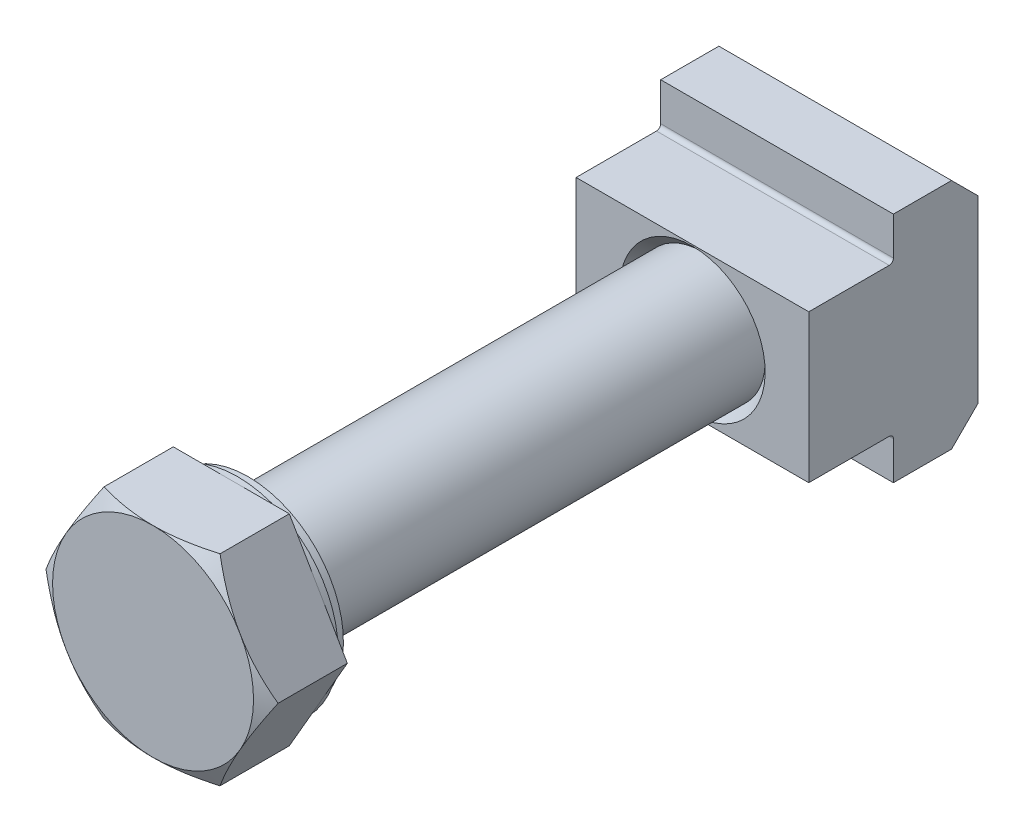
ISO-10303-21;
HEADER;
FILE_DESCRIPTION(('STEP AP214'),'2;1');
FILE_NAME('part.step','',(''),(''),'','','');
FILE_SCHEMA(('AUTOMOTIVE_DESIGN { 1 0 10303 214 1 1 1 1 }'));
ENDSEC;
DATA;
#1=APPLICATION_CONTEXT('core data for automotive mechanical design processes');
#2=APPLICATION_PROTOCOL_DEFINITION('international standard','automotive_design',2000,#1);
#3=PRODUCT_CONTEXT('',#1,'mechanical');
#4=PRODUCT('Part','Part','',(#3));
#5=PRODUCT_RELATED_PRODUCT_CATEGORY('part','',(#4));
#6=PRODUCT_DEFINITION_FORMATION('','',#4);
#7=PRODUCT_DEFINITION_CONTEXT('part definition',#1,'design');
#8=PRODUCT_DEFINITION('design','',#6,#7);
#9=PRODUCT_DEFINITION_SHAPE('','',#8);
#10=(LENGTH_UNIT() NAMED_UNIT(*) SI_UNIT(.MILLI.,.METRE.));
#11=(NAMED_UNIT(*) PLANE_ANGLE_UNIT() SI_UNIT($,.RADIAN.));
#12=(NAMED_UNIT(*) SI_UNIT($,.STERADIAN.) SOLID_ANGLE_UNIT());
#13=UNCERTAINTY_MEASURE_WITH_UNIT(LENGTH_MEASURE(1.E-05),#10,'distance_accuracy_value','');
#14=(GEOMETRIC_REPRESENTATION_CONTEXT(3) GLOBAL_UNCERTAINTY_ASSIGNED_CONTEXT((#13)) GLOBAL_UNIT_ASSIGNED_CONTEXT((#10,
#11,#12)) REPRESENTATION_CONTEXT('',''));
#15=CARTESIAN_POINT('',(0.,0.,0.));
#16=DIRECTION('',(0.,0.,1.));
#17=DIRECTION('',(1.,0.,0.));
#18=AXIS2_PLACEMENT_3D('',#15,#16,#17);
#19=CARTESIAN_POINT('',(4.75,0.,9.));
#20=DIRECTION('',(0.,0.,1.));
#21=DIRECTION('',(0.,-1.,0.));
#22=AXIS2_PLACEMENT_3D('',#19,#20,#21);
#23=PLANE('',#22);
#24=CARTESIAN_POINT('',(0.,0.,9.));
#25=DIRECTION('',(0.,0.,-1.));
#26=DIRECTION('',(0.,1.,0.));
#27=AXIS2_PLACEMENT_3D('',#24,#25,#26);
#28=CIRCLE('',#27,9.5);
#29=CARTESIAN_POINT('',(0.,-9.5,9.));
#30=VERTEX_POINT('',#29);
#31=CARTESIAN_POINT('',(-8.2272413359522,-4.75,9.));
#32=VERTEX_POINT('',#31);
#33=EDGE_CURVE('E258',#30,#32,#28,.T.);
#34=ORIENTED_EDGE('',*,*,#33,.F.);
#35=CARTESIAN_POINT('',(0.,0.,9.));
#36=DIRECTION('',(0.,0.,-1.));
#37=DIRECTION('',(0.,1.,0.));
#38=AXIS2_PLACEMENT_3D('',#35,#36,#37);
#39=CIRCLE('',#38,9.5);
#40=CARTESIAN_POINT('',(8.2272413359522,-4.75,9.));
#41=VERTEX_POINT('',#40);
#42=EDGE_CURVE('E252',#41,#30,#39,.T.);
#43=ORIENTED_EDGE('',*,*,#42,.F.);
#44=CARTESIAN_POINT('',(0.,0.,9.));
#45=DIRECTION('',(0.,0.,-1.));
#46=DIRECTION('',(0.,1.,0.));
#47=AXIS2_PLACEMENT_3D('',#44,#45,#46);
#48=CIRCLE('',#47,9.5);
#49=CARTESIAN_POINT('',(8.2272413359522,4.75,9.));
#50=VERTEX_POINT('',#49);
#51=EDGE_CURVE('E249',#50,#41,#48,.T.);
#52=ORIENTED_EDGE('',*,*,#51,.F.);
#53=CARTESIAN_POINT('',(0.,0.,9.));
#54=DIRECTION('',(0.,0.,-1.));
#55=DIRECTION('',(0.,1.,0.));
#56=AXIS2_PLACEMENT_3D('',#53,#54,#55);
#57=CIRCLE('',#56,9.5);
#58=CARTESIAN_POINT('',(0.,9.5,9.));
#59=VERTEX_POINT('',#58);
#60=EDGE_CURVE('E245',#59,#50,#57,.T.);
#61=ORIENTED_EDGE('',*,*,#60,.F.);
#62=CARTESIAN_POINT('',(0.,0.,9.));
#63=DIRECTION('',(0.,0.,-1.));
#64=DIRECTION('',(0.,1.,0.));
#65=AXIS2_PLACEMENT_3D('',#62,#63,#64);
#66=CIRCLE('',#65,9.5);
#67=CARTESIAN_POINT('',(-8.2272413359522,4.75,9.));
#68=VERTEX_POINT('',#67);
#69=EDGE_CURVE('E255',#68,#59,#66,.T.);
#70=ORIENTED_EDGE('',*,*,#69,.F.);
#71=CARTESIAN_POINT('',(0.,0.,9.));
#72=DIRECTION('',(0.,0.,-1.));
#73=DIRECTION('',(0.,1.,0.));
#74=AXIS2_PLACEMENT_3D('',#71,#72,#73);
#75=CIRCLE('',#74,9.5);
#76=EDGE_CURVE('E261',#32,#68,#75,.T.);
#77=ORIENTED_EDGE('',*,*,#76,.F.);
#78=EDGE_LOOP('',(#34,#43,#52,#61,#70,#77));
#79=FACE_BOUND('',#78,.T.);
#80=ADVANCED_FACE('F14',(#79),#23,.T.);
#81=CARTESIAN_POINT('',(0.,0.,8.1464031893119));
#82=DIRECTION('',(0.,0.,-1.));
#83=DIRECTION('',(0.,1.,0.));
#84=AXIS2_PLACEMENT_3D('',#81,#82,#83);
#85=CONICAL_SURFACE('',#84,10.9784730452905,1.0471975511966);
#86=CARTESIAN_POINT('',(-10.9696551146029,0.,8.1514942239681));
#87=CARTESIAN_POINT('',(-10.7464238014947,-0.386647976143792,8.28040921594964));
#88=CARTESIAN_POINT('',(-10.5214047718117,-0.776392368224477,8.3985178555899));
#89=CARTESIAN_POINT('',(-10.0693831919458,-1.55931671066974,8.60680031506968));
#90=CARTESIAN_POINT('',(-9.84239640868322,-1.95246935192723,8.69711226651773));
#91=CARTESIAN_POINT('',(-9.4997740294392,-2.545908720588,8.80800000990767));
#92=CARTESIAN_POINT('',(-9.3851337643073,-2.74447148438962,8.84087935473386));
#93=CARTESIAN_POINT('',(-9.15530440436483,-3.14254761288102,8.89779418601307));
#94=CARTESIAN_POINT('',(-9.04011532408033,-3.34206095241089,8.92182990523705));
#95=CARTESIAN_POINT('',(-8.80876226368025,-3.74277620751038,8.96063517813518));
#96=CARTESIAN_POINT('',(-8.69259629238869,-3.94398157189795,8.97535760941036));
#97=CARTESIAN_POINT('',(-8.46003588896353,-4.34678800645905,8.99506039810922));
#98=CARTESIAN_POINT('',(-8.34364141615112,-4.54838914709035,9.00003882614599));
#99=CARTESIAN_POINT('',(-8.2272413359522,-4.75,9.));
#100=B_SPLINE_CURVE_WITH_KNOTS('',3,(#86,#87,#88,#89,#90,#91,#92,#93,#94,#95,#96,#97,#98,#99),
.UNSPECIFIED.,.F.,.F.,(4,2,2,2,2,2,4),(0.,1.39466965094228,2.78229242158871,3.47701423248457,
4.17171775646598,4.86990873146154,5.56823793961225),.UNSPECIFIED.);
#101=CARTESIAN_POINT('',(-10.9696551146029,0.,8.1514942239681));
#102=VERTEX_POINT('',#101);
#103=EDGE_CURVE('E136',#102,#32,#100,.T.);
#104=ORIENTED_EDGE('',*,*,#103,.T.);
#105=ORIENTED_EDGE('',*,*,#76,.T.);
#106=CARTESIAN_POINT('',(-8.2272413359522,4.75,9.));
#107=CARTESIAN_POINT('',(-8.34364141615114,4.54838914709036,9.00003882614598));
#108=CARTESIAN_POINT('',(-8.46003588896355,4.34678800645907,8.99506039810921));
#109=CARTESIAN_POINT('',(-8.69259629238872,3.94398157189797,8.97535760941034));
#110=CARTESIAN_POINT('',(-8.80876226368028,3.7427762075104,8.96063517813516));
#111=CARTESIAN_POINT('',(-9.04011532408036,3.34206095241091,8.92182990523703));
#112=CARTESIAN_POINT('',(-9.15530440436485,3.14254761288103,8.89779418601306));
#113=CARTESIAN_POINT('',(-9.38513376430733,2.74447148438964,8.84087935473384));
#114=CARTESIAN_POINT('',(-9.49977402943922,2.54590872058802,8.80800000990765));
#115=CARTESIAN_POINT('',(-9.84239640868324,1.95246935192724,8.69711226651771));
#116=CARTESIAN_POINT('',(-10.0693831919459,1.55931671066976,8.60680031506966));
#117=CARTESIAN_POINT('',(-10.5214047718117,0.776392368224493,8.39851785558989));
#118=CARTESIAN_POINT('',(-10.7464238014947,0.386647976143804,8.28040921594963));
#119=CARTESIAN_POINT('',(-10.9696551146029,0.,8.1514942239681));
#120=B_SPLINE_CURVE_WITH_KNOTS('',3,(#106,#107,#108,#109,#110,#111,#112,#113,#114,#115,#116,
#117,#118,#119),.UNSPECIFIED.,.F.,.F.,(4,2,2,2,2,2,4),(0.,0.698329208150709,1.39652018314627,
2.09122370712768,2.78594551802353,4.17356828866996,5.56823793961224),.UNSPECIFIED.);
#121=EDGE_CURVE('E356',#68,#102,#120,.T.);
#122=ORIENTED_EDGE('',*,*,#121,.T.);
#123=EDGE_LOOP('',(#104,#105,#122));
#124=FACE_BOUND('',#123,.T.);
#125=ADVANCED_FACE('F387',(#124),#85,.T.);
#126=CARTESIAN_POINT('',(0.,0.,8.14640318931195));
#127=DIRECTION('',(0.,0.,-1.));
#128=DIRECTION('',(0.,1.,0.));
#129=AXIS2_PLACEMENT_3D('',#126,#127,#128);
#130=CONICAL_SURFACE('',#129,10.9784730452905,1.0471975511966);
#131=CARTESIAN_POINT('',(-5.48482755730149,-9.5,8.1514942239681));
#132=CARTESIAN_POINT('',(-5.038364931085,-9.5,8.28040921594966));
#133=CARTESIAN_POINT('',(-4.58832687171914,-9.5,8.39851785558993));
#134=CARTESIAN_POINT('',(-3.68428371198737,-9.5,8.60680031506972));
#135=CARTESIAN_POINT('',(-3.23031014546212,-9.5,8.69711226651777));
#136=CARTESIAN_POINT('',(-2.54506538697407,-9.5,8.80800000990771));
#137=CARTESIAN_POINT('',(-2.31578485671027,-9.5,8.8408793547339));
#138=CARTESIAN_POINT('',(-1.85612613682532,-9.5,8.89779418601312));
#139=CARTESIAN_POINT('',(-1.62574797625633,-9.5,8.92182990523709));
#140=CARTESIAN_POINT('',(-1.16304185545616,-9.5,8.96063517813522));
#141=CARTESIAN_POINT('',(-0.930709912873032,-9.5,8.97535760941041));
#142=CARTESIAN_POINT('',(-0.465589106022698,-9.5,8.99506039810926));
#143=CARTESIAN_POINT('',(-0.232800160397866,-9.5,9.00003882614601));
#144=CARTESIAN_POINT('',(0.,-9.5,9.));
#145=B_SPLINE_CURVE_WITH_KNOTS('',3,(#131,#132,#133,#134,#135,#136,#137,#138,#139,#140,#141,
#142,#143,#144),.UNSPECIFIED.,.F.,.F.,(4,2,2,2,2,2,4),(0.,1.3946696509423,2.78229242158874,
3.47701423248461,4.17171775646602,4.86990873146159,5.56823793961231),.UNSPECIFIED.);
#146=CARTESIAN_POINT('',(-5.48482755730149,-9.5,8.1514942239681));
#147=VERTEX_POINT('',#146);
#148=EDGE_CURVE('E206',#147,#30,#145,.T.);
#149=ORIENTED_EDGE('',*,*,#148,.T.);
#150=ORIENTED_EDGE('',*,*,#33,.T.);
#151=CARTESIAN_POINT('',(-8.2272413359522,-4.75,9.));
#152=CARTESIAN_POINT('',(-8.11084125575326,-4.95161085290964,9.00003882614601));
#153=CARTESIAN_POINT('',(-7.99444678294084,-5.15321199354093,8.99506039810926));
#154=CARTESIAN_POINT('',(-7.76188637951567,-5.55601842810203,8.9753576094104));
#155=CARTESIAN_POINT('',(-7.64572040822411,-5.7572237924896,8.96063517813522));
#156=CARTESIAN_POINT('',(-7.41436734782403,-6.1579390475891,8.92182990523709));
#157=CARTESIAN_POINT('',(-7.29917826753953,-6.35745238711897,8.89779418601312));
#158=CARTESIAN_POINT('',(-7.06934890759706,-6.75552851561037,8.8408793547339));
#159=CARTESIAN_POINT('',(-6.95470864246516,-6.95409127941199,8.80800000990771));
#160=CARTESIAN_POINT('',(-6.61208626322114,-7.54753064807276,8.69711226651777));
#161=CARTESIAN_POINT('',(-6.38509947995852,-7.94068328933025,8.60680031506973));
#162=CARTESIAN_POINT('',(-5.93307790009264,-8.72360763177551,8.39851785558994));
#163=CARTESIAN_POINT('',(-5.70805887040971,-9.1133520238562,8.28040921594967));
#164=CARTESIAN_POINT('',(-5.48482755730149,-9.5,8.1514942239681));
#165=B_SPLINE_CURVE_WITH_KNOTS('',3,(#151,#152,#153,#154,#155,#156,#157,#158,#159,#160,#161,
#162,#163,#164),.UNSPECIFIED.,.F.,.F.,(4,2,2,2,2,2,4),(0.,0.698329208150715,1.39652018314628,
2.09122370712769,2.78594551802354,4.17356828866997,5.56823793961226),.UNSPECIFIED.);
#166=EDGE_CURVE('E198',#32,#147,#165,.T.);
#167=ORIENTED_EDGE('',*,*,#166,.T.);
#168=EDGE_LOOP('',(#149,#150,#167));
#169=FACE_BOUND('',#168,.T.);
#170=ADVANCED_FACE('F340',(#169),#130,.T.);
#171=CARTESIAN_POINT('',(0.,0.,8.14640318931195));
#172=DIRECTION('',(0.,0.,-1.));
#173=DIRECTION('',(0.,1.,0.));
#174=AXIS2_PLACEMENT_3D('',#171,#172,#173);
#175=CONICAL_SURFACE('',#174,10.9784730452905,1.0471975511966);
#176=CARTESIAN_POINT('',(5.4848275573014,-9.5,8.1514942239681));
#177=CARTESIAN_POINT('',(5.70805887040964,-9.11335202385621,8.28040921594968));
#178=CARTESIAN_POINT('',(5.93307790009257,-8.72360763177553,8.39851785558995));
#179=CARTESIAN_POINT('',(6.38509947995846,-7.94068328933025,8.60680031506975));
#180=CARTESIAN_POINT('',(6.61208626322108,-7.54753064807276,8.69711226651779));
#181=CARTESIAN_POINT('',(6.95470864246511,-6.95409127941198,8.80800000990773));
#182=CARTESIAN_POINT('',(7.06934890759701,-6.75552851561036,8.84087935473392));
#183=CARTESIAN_POINT('',(7.29917826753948,-6.35745238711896,8.89779418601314));
#184=CARTESIAN_POINT('',(7.41436734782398,-6.15793904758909,8.92182990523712));
#185=CARTESIAN_POINT('',(7.64572040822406,-5.75722379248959,8.96063517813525));
#186=CARTESIAN_POINT('',(7.76188637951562,-5.55601842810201,8.97535760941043));
#187=CARTESIAN_POINT('',(7.9944467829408,-5.15321199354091,8.99506039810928));
#188=CARTESIAN_POINT('',(8.11084125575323,-4.95161085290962,9.00003882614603));
#189=CARTESIAN_POINT('',(8.2272413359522,-4.75,9.));
#190=B_SPLINE_CURVE_WITH_KNOTS('',3,(#176,#177,#178,#179,#180,#181,#182,#183,#184,#185,#186,
#187,#188,#189),.UNSPECIFIED.,.F.,.F.,(4,2,2,2,2,2,4),(0.,1.3946696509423,2.78229242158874,
3.4770142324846,4.17171775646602,4.86990873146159,5.56823793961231),.UNSPECIFIED.);
#191=CARTESIAN_POINT('',(5.4848275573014,-9.5,8.1514942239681));
#192=VERTEX_POINT('',#191);
#193=EDGE_CURVE('E218',#192,#41,#190,.T.);
#194=ORIENTED_EDGE('',*,*,#193,.T.);
#195=ORIENTED_EDGE('',*,*,#42,.T.);
#196=CARTESIAN_POINT('',(0.,-9.5,9.));
#197=CARTESIAN_POINT('',(0.232800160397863,-9.5,9.00003882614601));
#198=CARTESIAN_POINT('',(0.465589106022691,-9.5,8.99506039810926));
#199=CARTESIAN_POINT('',(0.930709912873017,-9.5,8.97535760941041));
#200=CARTESIAN_POINT('',(1.16304185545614,-9.5,8.96063517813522));
#201=CARTESIAN_POINT('',(1.6257479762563,-9.5,8.92182990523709));
#202=CARTESIAN_POINT('',(1.85612613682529,-9.5,8.89779418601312));
#203=CARTESIAN_POINT('',(2.31578485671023,-9.5,8.8408793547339));
#204=CARTESIAN_POINT('',(2.54506538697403,-9.5,8.80800000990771));
#205=CARTESIAN_POINT('',(3.23031014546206,-9.5,8.69711226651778));
#206=CARTESIAN_POINT('',(3.68428371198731,-9.50000000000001,8.60680031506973));
#207=CARTESIAN_POINT('',(4.58832687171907,-9.50000000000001,8.39851785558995));
#208=CARTESIAN_POINT('',(5.03836493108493,-9.50000000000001,8.28040921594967));
#209=CARTESIAN_POINT('',(5.4848275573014,-9.5,8.1514942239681));
#210=B_SPLINE_CURVE_WITH_KNOTS('',3,(#196,#197,#198,#199,#200,#201,#202,#203,#204,#205,#206,
#207,#208,#209),.UNSPECIFIED.,.F.,.F.,(4,2,2,2,2,2,4),(0.,0.69832920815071,1.39652018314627,
2.09122370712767,2.78594551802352,4.17356828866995,5.56823793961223),.UNSPECIFIED.);
#211=EDGE_CURVE('E212',#30,#192,#210,.T.);
#212=ORIENTED_EDGE('',*,*,#211,.T.);
#213=EDGE_LOOP('',(#194,#195,#212));
#214=FACE_BOUND('',#213,.T.);
#215=ADVANCED_FACE('F337',(#214),#175,.T.);
#216=CARTESIAN_POINT('',(0.,0.,8.14640318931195));
#217=DIRECTION('',(0.,0.,-1.));
#218=DIRECTION('',(0.,1.,0.));
#219=AXIS2_PLACEMENT_3D('',#216,#217,#218);
#220=CONICAL_SURFACE('',#219,10.9784730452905,1.0471975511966);
#221=ORIENTED_EDGE('',*,*,#69,.T.);
#222=CARTESIAN_POINT('',(0.,9.5,9.));
#223=CARTESIAN_POINT('',(-0.232800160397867,9.5,9.00003882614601));
#224=CARTESIAN_POINT('',(-0.465589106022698,9.5,8.99506039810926));
#225=CARTESIAN_POINT('',(-0.930709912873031,9.5,8.9753576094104));
#226=CARTESIAN_POINT('',(-1.16304185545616,9.5,8.96063517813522));
#227=CARTESIAN_POINT('',(-1.62574797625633,9.5,8.92182990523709));
#228=CARTESIAN_POINT('',(-1.85612613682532,9.5,8.89779418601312));
#229=CARTESIAN_POINT('',(-2.31578485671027,9.5,8.8408793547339));
#230=CARTESIAN_POINT('',(-2.54506538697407,9.5,8.8080000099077));
#231=CARTESIAN_POINT('',(-3.23031014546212,9.5,8.69711226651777));
#232=CARTESIAN_POINT('',(-3.68428371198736,9.50000000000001,8.60680031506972));
#233=CARTESIAN_POINT('',(-4.58832687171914,9.50000000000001,8.39851785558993));
#234=CARTESIAN_POINT('',(-5.038364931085,9.50000000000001,8.28040921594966));
#235=CARTESIAN_POINT('',(-5.48482755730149,9.5,8.1514942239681));
#236=B_SPLINE_CURVE_WITH_KNOTS('',3,(#222,#223,#224,#225,#226,#227,#228,#229,#230,#231,#232,
#233,#234,#235),.UNSPECIFIED.,.F.,.F.,(4,2,2,2,2,2,4),(0.,0.698329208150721,1.39652018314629,
2.09122370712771,2.78594551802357,4.17356828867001,5.56823793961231),.UNSPECIFIED.);
#237=CARTESIAN_POINT('',(-5.48482755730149,9.5,8.1514942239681));
#238=VERTEX_POINT('',#237);
#239=EDGE_CURVE('E223',#59,#238,#236,.T.);
#240=ORIENTED_EDGE('',*,*,#239,.T.);
#241=CARTESIAN_POINT('',(-5.48482755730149,9.5,8.1514942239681));
#242=CARTESIAN_POINT('',(-5.70805887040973,9.11335202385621,8.28040921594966));
#243=CARTESIAN_POINT('',(-5.93307790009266,8.72360763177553,8.39851785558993));
#244=CARTESIAN_POINT('',(-6.38509947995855,7.94068328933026,8.60680031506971));
#245=CARTESIAN_POINT('',(-6.61208626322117,7.54753064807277,8.69711226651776));
#246=CARTESIAN_POINT('',(-6.95470864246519,6.954091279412,8.80800000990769));
#247=CARTESIAN_POINT('',(-7.06934890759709,6.75552851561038,8.84087935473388));
#248=CARTESIAN_POINT('',(-7.29917826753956,6.35745238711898,8.8977941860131));
#249=CARTESIAN_POINT('',(-7.41436734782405,6.15793904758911,8.92182990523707));
#250=CARTESIAN_POINT('',(-7.64572040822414,5.75722379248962,8.9606351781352));
#251=CARTESIAN_POINT('',(-7.7618863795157,5.55601842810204,8.97535760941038));
#252=CARTESIAN_POINT('',(-7.99444678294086,5.15321199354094,8.99506039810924));
#253=CARTESIAN_POINT('',(-8.11084125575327,4.95161085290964,9.000038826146));
#254=CARTESIAN_POINT('',(-8.2272413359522,4.75,9.));
#255=B_SPLINE_CURVE_WITH_KNOTS('',3,(#241,#242,#243,#244,#245,#246,#247,#248,#249,#250,#251,
#252,#253,#254),.UNSPECIFIED.,.F.,.F.,(4,2,2,2,2,2,4),(0.,1.39466965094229,2.78229242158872,
3.47701423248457,4.17171775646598,4.86990873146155,5.56823793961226),.UNSPECIFIED.);
#256=EDGE_CURVE('E207',#238,#68,#255,.T.);
#257=ORIENTED_EDGE('',*,*,#256,.T.);
#258=EDGE_LOOP('',(#221,#240,#257));
#259=FACE_BOUND('',#258,.T.);
#260=ADVANCED_FACE('F288',(#259),#220,.T.);
#261=CARTESIAN_POINT('',(0.,0.,8.14640318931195));
#262=DIRECTION('',(0.,0.,-1.));
#263=DIRECTION('',(0.,1.,0.));
#264=AXIS2_PLACEMENT_3D('',#261,#262,#263);
#265=CONICAL_SURFACE('',#264,10.9784730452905,1.0471975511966);
#266=ORIENTED_EDGE('',*,*,#60,.T.);
#267=CARTESIAN_POINT('',(8.2272413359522,4.75,9.));
#268=CARTESIAN_POINT('',(8.11084125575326,4.95161085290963,9.00003882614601));
#269=CARTESIAN_POINT('',(7.99444678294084,5.15321199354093,8.99506039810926));
#270=CARTESIAN_POINT('',(7.76188637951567,5.55601842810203,8.9753576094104));
#271=CARTESIAN_POINT('',(7.64572040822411,5.7572237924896,8.96063517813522));
#272=CARTESIAN_POINT('',(7.41436734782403,6.15793904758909,8.92182990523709));
#273=CARTESIAN_POINT('',(7.29917826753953,6.35745238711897,8.89779418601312));
#274=CARTESIAN_POINT('',(7.06934890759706,6.75552851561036,8.8408793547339));
#275=CARTESIAN_POINT('',(6.95470864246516,6.95409127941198,8.80800000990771));
#276=CARTESIAN_POINT('',(6.61208626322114,7.54753064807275,8.69711226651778));
#277=CARTESIAN_POINT('',(6.38509947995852,7.94068328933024,8.60680031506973));
#278=CARTESIAN_POINT('',(5.93307790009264,8.72360763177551,8.39851785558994));
#279=CARTESIAN_POINT('',(5.70805887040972,9.1133520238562,8.28040921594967));
#280=CARTESIAN_POINT('',(5.48482755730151,9.5,8.1514942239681));
#281=B_SPLINE_CURVE_WITH_KNOTS('',3,(#267,#268,#269,#270,#271,#272,#273,#274,#275,#276,#277,
#278,#279,#280),.UNSPECIFIED.,.F.,.F.,(4,2,2,2,2,2,4),(0.,0.698329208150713,1.39652018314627,
2.09122370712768,2.78594551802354,4.17356828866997,5.56823793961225),.UNSPECIFIED.);
#282=CARTESIAN_POINT('',(5.4848275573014,9.5,8.1514942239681));
#283=VERTEX_POINT('',#282);
#284=EDGE_CURVE('E294',#50,#283,#281,.T.);
#285=ORIENTED_EDGE('',*,*,#284,.T.);
#286=CARTESIAN_POINT('',(5.4848275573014,9.5,8.1514942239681));
#287=CARTESIAN_POINT('',(5.03836493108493,9.5,8.28040921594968));
#288=CARTESIAN_POINT('',(4.58832687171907,9.5,8.39851785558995));
#289=CARTESIAN_POINT('',(3.68428371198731,9.5,8.60680031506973));
#290=CARTESIAN_POINT('',(3.23031014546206,9.5,8.69711226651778));
#291=CARTESIAN_POINT('',(2.54506538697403,9.5,8.80800000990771));
#292=CARTESIAN_POINT('',(2.31578485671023,9.5,8.84087935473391));
#293=CARTESIAN_POINT('',(1.85612613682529,9.5,8.89779418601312));
#294=CARTESIAN_POINT('',(1.6257479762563,9.5,8.92182990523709));
#295=CARTESIAN_POINT('',(1.16304185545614,9.5,8.96063517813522));
#296=CARTESIAN_POINT('',(0.930709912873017,9.5,8.97535760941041));
#297=CARTESIAN_POINT('',(0.465589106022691,9.5,8.99506039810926));
#298=CARTESIAN_POINT('',(0.232800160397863,9.5,9.00003882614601));
#299=CARTESIAN_POINT('',(0.,9.5,9.));
#300=B_SPLINE_CURVE_WITH_KNOTS('',3,(#286,#287,#288,#289,#290,#291,#292,#293,#294,#295,#296,
#297,#298,#299),.UNSPECIFIED.,.F.,.F.,(4,2,2,2,2,2,4),(0.,1.39466965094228,2.7822924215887,
3.47701423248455,4.17171775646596,4.86990873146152,5.56823793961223),.UNSPECIFIED.);
#301=EDGE_CURVE('E263',#283,#59,#300,.T.);
#302=ORIENTED_EDGE('',*,*,#301,.T.);
#303=EDGE_LOOP('',(#266,#285,#302));
#304=FACE_BOUND('',#303,.T.);
#305=ADVANCED_FACE('F282',(#304),#265,.T.);
#306=CARTESIAN_POINT('',(0.,0.,8.1464031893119));
#307=DIRECTION('',(0.,0.,-1.));
#308=DIRECTION('',(0.,1.,0.));
#309=AXIS2_PLACEMENT_3D('',#306,#307,#308);
#310=CONICAL_SURFACE('',#309,10.9784730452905,1.0471975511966);
#311=ORIENTED_EDGE('',*,*,#51,.T.);
#312=CARTESIAN_POINT('',(8.2272413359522,-4.75,9.));
#313=CARTESIAN_POINT('',(8.34364141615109,-4.54838914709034,9.000038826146));
#314=CARTESIAN_POINT('',(8.46003588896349,-4.34678800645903,8.99506039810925));
#315=CARTESIAN_POINT('',(8.69259629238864,-3.94398157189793,8.97535760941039));
#316=CARTESIAN_POINT('',(8.80876226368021,-3.74277620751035,8.9606351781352));
#317=CARTESIAN_POINT('',(9.0401153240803,-3.34206095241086,8.92182990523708));
#318=CARTESIAN_POINT('',(9.15530440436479,-3.14254761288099,8.8977941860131));
#319=CARTESIAN_POINT('',(9.38513376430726,-2.74447148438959,8.84087935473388));
#320=CARTESIAN_POINT('',(9.49977402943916,-2.54590872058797,8.80800000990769));
#321=CARTESIAN_POINT('',(9.84239640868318,-1.9524693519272,8.69711226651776));
#322=CARTESIAN_POINT('',(10.0693831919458,-1.55931671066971,8.60680031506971));
#323=CARTESIAN_POINT('',(10.5214047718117,-0.776392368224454,8.39851785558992));
#324=CARTESIAN_POINT('',(10.7464238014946,-0.386647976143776,8.28040921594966));
#325=CARTESIAN_POINT('',(10.9696551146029,0.,8.1514942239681));
#326=B_SPLINE_CURVE_WITH_KNOTS('',3,(#312,#313,#314,#315,#316,#317,#318,#319,#320,#321,#322,
#323,#324,#325),.UNSPECIFIED.,.F.,.F.,(4,2,2,2,2,2,4),(0.,0.698329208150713,1.39652018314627,
2.09122370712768,2.78594551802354,4.17356828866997,5.56823793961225),.UNSPECIFIED.);
#327=CARTESIAN_POINT('',(10.9696551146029,0.,8.1514942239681));
#328=VERTEX_POINT('',#327);
#329=EDGE_CURVE('E217',#41,#328,#326,.T.);
#330=ORIENTED_EDGE('',*,*,#329,.T.);
#331=CARTESIAN_POINT('',(10.9696551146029,0.,8.1514942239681));
#332=CARTESIAN_POINT('',(10.7464238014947,0.386647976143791,8.28040921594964));
#333=CARTESIAN_POINT('',(10.5214047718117,0.776392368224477,8.3985178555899));
#334=CARTESIAN_POINT('',(10.0693831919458,1.55931671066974,8.60680031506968));
#335=CARTESIAN_POINT('',(9.84239640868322,1.95246935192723,8.69711226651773));
#336=CARTESIAN_POINT('',(9.4997740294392,2.545908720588,8.80800000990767));
#337=CARTESIAN_POINT('',(9.3851337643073,2.74447148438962,8.84087935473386));
#338=CARTESIAN_POINT('',(9.15530440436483,3.14254761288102,8.89779418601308));
#339=CARTESIAN_POINT('',(9.04011532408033,3.34206095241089,8.92182990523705));
#340=CARTESIAN_POINT('',(8.80876226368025,3.74277620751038,8.96063517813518));
#341=CARTESIAN_POINT('',(8.69259629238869,3.94398157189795,8.97535760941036));
#342=CARTESIAN_POINT('',(8.46003588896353,4.34678800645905,8.99506039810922));
#343=CARTESIAN_POINT('',(8.34364141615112,4.54838914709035,9.00003882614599));
#344=CARTESIAN_POINT('',(8.2272413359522,4.75,9.));
#345=B_SPLINE_CURVE_WITH_KNOTS('',3,(#331,#332,#333,#334,#335,#336,#337,#338,#339,#340,#341,
#342,#343,#344),.UNSPECIFIED.,.F.,.F.,(4,2,2,2,2,2,4),(0.,1.39466965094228,2.78229242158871,
3.47701423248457,4.17171775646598,4.86990873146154,5.56823793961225),.UNSPECIFIED.);
#346=EDGE_CURVE('E224',#328,#50,#345,.T.);
#347=ORIENTED_EDGE('',*,*,#346,.T.);
#348=EDGE_LOOP('',(#311,#330,#347));
#349=FACE_BOUND('',#348,.T.);
#350=ADVANCED_FACE('F287',(#349),#310,.T.);
#351=CARTESIAN_POINT('',(-5.48482755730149,9.5,1.));
#352=DIRECTION('',(0.866025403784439,-0.5,0.));
#353=DIRECTION('',(-0.5,-0.866025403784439,0.));
#354=AXIS2_PLACEMENT_3D('',#351,#352,#353);
#355=PLANE('',#354);
#356=ORIENTED_EDGE('',*,*,#256,.F.);
#357=DIRECTION('',(0.,0.,-1.));
#358=VECTOR('',#357,1.);
#359=CARTESIAN_POINT('',(-5.48482755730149,9.5,1.));
#360=LINE('',#359,#358);
#361=CARTESIAN_POINT('',(-5.48482755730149,9.5,1.6));
#362=VERTEX_POINT('',#361);
#363=EDGE_CURVE('E203',#362,#238,#360,.F.);
#364=ORIENTED_EDGE('',*,*,#363,.F.);
#365=DIRECTION('',(0.5,0.866025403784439,0.));
#366=VECTOR('',#365,1.);
#367=CARTESIAN_POINT('',(-8.2272413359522,4.75,1.6));
#368=LINE('',#367,#366);
#369=CARTESIAN_POINT('',(-8.2272413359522,4.75,1.6));
#370=VERTEX_POINT('',#369);
#371=EDGE_CURVE('E123',#370,#362,#368,.T.);
#372=ORIENTED_EDGE('',*,*,#371,.F.);
#373=DIRECTION('',(0.5,0.866025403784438,0.));
#374=VECTOR('',#373,1.);
#375=CARTESIAN_POINT('',(-10.9696551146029,0.,1.6));
#376=LINE('',#375,#374);
#377=CARTESIAN_POINT('',(-10.9696551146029,0.,1.6));
#378=VERTEX_POINT('',#377);
#379=EDGE_CURVE('E115',#378,#370,#376,.T.);
#380=ORIENTED_EDGE('',*,*,#379,.F.);
#381=DIRECTION('',(0.,0.,-1.));
#382=VECTOR('',#381,1.);
#383=CARTESIAN_POINT('',(-10.9696551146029,0.,1.));
#384=LINE('',#383,#382);
#385=EDGE_CURVE('E120',#378,#102,#384,.F.);
#386=ORIENTED_EDGE('',*,*,#385,.T.);
#387=ORIENTED_EDGE('',*,*,#121,.F.);
#388=EDGE_LOOP('',(#356,#364,#372,#380,#386,#387));
#389=FACE_BOUND('',#388,.T.);
#390=ADVANCED_FACE('F118',(#389),#355,.F.);
#391=CARTESIAN_POINT('',(-10.9696551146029,0.,1.));
#392=DIRECTION('',(0.866025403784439,0.5,0.));
#393=DIRECTION('',(0.5,-0.866025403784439,0.));
#394=AXIS2_PLACEMENT_3D('',#391,#392,#393);
#395=PLANE('',#394);
#396=ORIENTED_EDGE('',*,*,#385,.F.);
#397=DIRECTION('',(-0.5,0.866025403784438,0.));
#398=VECTOR('',#397,1.);
#399=CARTESIAN_POINT('',(-8.2272413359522,-4.75,1.6));
#400=LINE('',#399,#398);
#401=CARTESIAN_POINT('',(-8.2272413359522,-4.75,1.6));
#402=VERTEX_POINT('',#401);
#403=EDGE_CURVE('E129',#402,#378,#400,.T.);
#404=ORIENTED_EDGE('',*,*,#403,.F.);
#405=DIRECTION('',(-0.5,0.866025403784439,0.));
#406=VECTOR('',#405,1.);
#407=CARTESIAN_POINT('',(-5.48482755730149,-9.5,1.6));
#408=LINE('',#407,#406);
#409=CARTESIAN_POINT('',(-5.48482755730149,-9.5,1.6));
#410=VERTEX_POINT('',#409);
#411=EDGE_CURVE('E151',#410,#402,#408,.T.);
#412=ORIENTED_EDGE('',*,*,#411,.F.);
#413=DIRECTION('',(0.,0.,-1.));
#414=VECTOR('',#413,1.);
#415=CARTESIAN_POINT('',(-5.48482755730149,-9.5,1.));
#416=LINE('',#415,#414);
#417=EDGE_CURVE('E108',#147,#410,#416,.T.);
#418=ORIENTED_EDGE('',*,*,#417,.F.);
#419=ORIENTED_EDGE('',*,*,#166,.F.);
#420=ORIENTED_EDGE('',*,*,#103,.F.);
#421=EDGE_LOOP('',(#396,#404,#412,#418,#419,#420));
#422=FACE_BOUND('',#421,.T.);
#423=ADVANCED_FACE('F132',(#422),#395,.F.);
#424=CARTESIAN_POINT('',(-5.48482755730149,-9.5,1.));
#425=DIRECTION('',(0.,1.,0.));
#426=DIRECTION('',(0.,0.,1.));
#427=AXIS2_PLACEMENT_3D('',#424,#425,#426);
#428=PLANE('',#427);
#429=ORIENTED_EDGE('',*,*,#417,.T.);
#430=DIRECTION('',(1.,0.,0.));
#431=VECTOR('',#430,1.);
#432=CARTESIAN_POINT('',(10.45,-9.5,1.6));
#433=LINE('',#432,#431);
#434=CARTESIAN_POINT('',(0.,-9.5,1.6));
#435=VERTEX_POINT('',#434);
#436=EDGE_CURVE('E128',#435,#410,#433,.F.);
#437=ORIENTED_EDGE('',*,*,#436,.F.);
#438=DIRECTION('',(1.,0.,0.));
#439=VECTOR('',#438,1.);
#440=CARTESIAN_POINT('',(10.45,-9.5,1.6));
#441=LINE('',#440,#439);
#442=CARTESIAN_POINT('',(5.4848275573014,-9.5,1.6));
#443=VERTEX_POINT('',#442);
#444=EDGE_CURVE('E160',#443,#435,#441,.F.);
#445=ORIENTED_EDGE('',*,*,#444,.F.);
#446=DIRECTION('',(0.,0.,1.));
#447=VECTOR('',#446,1.);
#448=CARTESIAN_POINT('',(5.4848275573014,-9.5,1.));
#449=LINE('',#448,#447);
#450=EDGE_CURVE('E210',#192,#443,#449,.F.);
#451=ORIENTED_EDGE('',*,*,#450,.F.);
#452=ORIENTED_EDGE('',*,*,#211,.F.);
#453=ORIENTED_EDGE('',*,*,#148,.F.);
#454=EDGE_LOOP('',(#429,#437,#445,#451,#452,#453));
#455=FACE_BOUND('',#454,.T.);
#456=ADVANCED_FACE('F321',(#455),#428,.F.);
#457=CARTESIAN_POINT('',(5.4848275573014,-9.5,1.));
#458=DIRECTION('',(-0.866025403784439,0.5,0.));
#459=DIRECTION('',(0.5,0.866025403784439,0.));
#460=AXIS2_PLACEMENT_3D('',#457,#458,#459);
#461=PLANE('',#460);
#462=ORIENTED_EDGE('',*,*,#450,.T.);
#463=DIRECTION('',(-0.5,-0.866025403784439,0.));
#464=VECTOR('',#463,1.);
#465=CARTESIAN_POINT('',(8.2272413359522,-4.75,1.6));
#466=LINE('',#465,#464);
#467=CARTESIAN_POINT('',(8.2272413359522,-4.75,1.6));
#468=VERTEX_POINT('',#467);
#469=EDGE_CURVE('E153',#468,#443,#466,.T.);
#470=ORIENTED_EDGE('',*,*,#469,.F.);
#471=DIRECTION('',(-0.5,-0.866025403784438,0.));
#472=VECTOR('',#471,1.);
#473=CARTESIAN_POINT('',(10.9696551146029,0.,1.6));
#474=LINE('',#473,#472);
#475=CARTESIAN_POINT('',(10.9696551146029,0.,1.6));
#476=VERTEX_POINT('',#475);
#477=EDGE_CURVE('E163',#476,#468,#474,.T.);
#478=ORIENTED_EDGE('',*,*,#477,.F.);
#479=DIRECTION('',(0.,0.,-1.));
#480=VECTOR('',#479,1.);
#481=CARTESIAN_POINT('',(10.9696551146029,0.,1.));
#482=LINE('',#481,#480);
#483=EDGE_CURVE('E215',#328,#476,#482,.T.);
#484=ORIENTED_EDGE('',*,*,#483,.F.);
#485=ORIENTED_EDGE('',*,*,#329,.F.);
#486=ORIENTED_EDGE('',*,*,#193,.F.);
#487=EDGE_LOOP('',(#462,#470,#478,#484,#485,#486));
#488=FACE_BOUND('',#487,.T.);
#489=ADVANCED_FACE('F316',(#488),#461,.F.);
#490=CARTESIAN_POINT('',(5.4848275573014,9.5,1.));
#491=DIRECTION('',(0.,-1.,0.));
#492=DIRECTION('',(0.,0.,-1.));
#493=AXIS2_PLACEMENT_3D('',#490,#491,#492);
#494=PLANE('',#493);
#495=ORIENTED_EDGE('',*,*,#301,.F.);
#496=DIRECTION('',(0.,0.,-1.));
#497=VECTOR('',#496,1.);
#498=CARTESIAN_POINT('',(5.48482755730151,9.5,1.));
#499=LINE('',#498,#497);
#500=CARTESIAN_POINT('',(5.4848275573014,9.5,1.6));
#501=VERTEX_POINT('',#500);
#502=EDGE_CURVE('E221',#283,#501,#499,.T.);
#503=ORIENTED_EDGE('',*,*,#502,.T.);
#504=DIRECTION('',(1.,0.,0.));
#505=VECTOR('',#504,1.);
#506=CARTESIAN_POINT('',(10.45,9.5,1.6));
#507=LINE('',#506,#505);
#508=CARTESIAN_POINT('',(0.,9.5,1.6));
#509=VERTEX_POINT('',#508);
#510=EDGE_CURVE('E180',#509,#501,#507,.T.);
#511=ORIENTED_EDGE('',*,*,#510,.F.);
#512=DIRECTION('',(1.,0.,0.));
#513=VECTOR('',#512,1.);
#514=CARTESIAN_POINT('',(10.45,9.5,1.6));
#515=LINE('',#514,#513);
#516=EDGE_CURVE('E183',#362,#509,#515,.T.);
#517=ORIENTED_EDGE('',*,*,#516,.F.);
#518=ORIENTED_EDGE('',*,*,#363,.T.);
#519=ORIENTED_EDGE('',*,*,#239,.F.);
#520=EDGE_LOOP('',(#495,#503,#511,#517,#518,#519));
#521=FACE_BOUND('',#520,.T.);
#522=ADVANCED_FACE('F278',(#521),#494,.F.);
#523=CARTESIAN_POINT('',(10.9696551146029,0.,1.));
#524=DIRECTION('',(-0.866025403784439,-0.5,0.));
#525=DIRECTION('',(-0.5,0.866025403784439,0.));
#526=AXIS2_PLACEMENT_3D('',#523,#524,#525);
#527=PLANE('',#526);
#528=ORIENTED_EDGE('',*,*,#346,.F.);
#529=ORIENTED_EDGE('',*,*,#483,.T.);
#530=DIRECTION('',(0.5,-0.866025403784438,0.));
#531=VECTOR('',#530,1.);
#532=CARTESIAN_POINT('',(8.2272413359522,4.75,1.6));
#533=LINE('',#532,#531);
#534=CARTESIAN_POINT('',(8.2272413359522,4.75,1.6));
#535=VERTEX_POINT('',#534);
#536=EDGE_CURVE('E170',#535,#476,#533,.T.);
#537=ORIENTED_EDGE('',*,*,#536,.F.);
#538=DIRECTION('',(0.5,-0.866025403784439,0.));
#539=VECTOR('',#538,1.);
#540=CARTESIAN_POINT('',(5.4848275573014,9.5,1.6));
#541=LINE('',#540,#539);
#542=EDGE_CURVE('E173',#501,#535,#541,.T.);
#543=ORIENTED_EDGE('',*,*,#542,.F.);
#544=ORIENTED_EDGE('',*,*,#502,.F.);
#545=ORIENTED_EDGE('',*,*,#284,.F.);
#546=EDGE_LOOP('',(#528,#529,#537,#543,#544,#545));
#547=FACE_BOUND('',#546,.T.);
#548=ADVANCED_FACE('F311',(#547),#527,.F.);
#549=CARTESIAN_POINT('',(10.45,0.,1.6));
#550=DIRECTION('',(0.,0.,-1.));
#551=DIRECTION('',(0.,1.,0.));
#552=AXIS2_PLACEMENT_3D('',#549,#550,#551);
#553=PLANE('',#552);
#554=ORIENTED_EDGE('',*,*,#516,.T.);
#555=CARTESIAN_POINT('',(0.,0.,1.6));
#556=DIRECTION('',(0.,0.,-1.));
#557=DIRECTION('',(0.,1.,0.));
#558=AXIS2_PLACEMENT_3D('',#555,#556,#557);
#559=CIRCLE('',#558,9.5);
#560=EDGE_CURVE('E141',#370,#509,#559,.T.);
#561=ORIENTED_EDGE('',*,*,#560,.F.);
#562=ORIENTED_EDGE('',*,*,#371,.T.);
#563=EDGE_LOOP('',(#554,#561,#562));
#564=FACE_BOUND('',#563,.T.);
#565=ADVANCED_FACE('F314',(#564),#553,.T.);
#566=CARTESIAN_POINT('',(10.45,0.,1.6));
#567=DIRECTION('',(0.,0.,-1.));
#568=DIRECTION('',(0.,1.,0.));
#569=AXIS2_PLACEMENT_3D('',#566,#567,#568);
#570=PLANE('',#569);
#571=CARTESIAN_POINT('',(0.,0.,1.6));
#572=DIRECTION('',(0.,0.,-1.));
#573=DIRECTION('',(0.,1.,0.));
#574=AXIS2_PLACEMENT_3D('',#571,#572,#573);
#575=CIRCLE('',#574,9.5);
#576=EDGE_CURVE('E139',#402,#370,#575,.T.);
#577=ORIENTED_EDGE('',*,*,#576,.F.);
#578=ORIENTED_EDGE('',*,*,#403,.T.);
#579=ORIENTED_EDGE('',*,*,#379,.T.);
#580=EDGE_LOOP('',(#577,#578,#579));
#581=FACE_BOUND('',#580,.T.);
#582=ADVANCED_FACE('F138',(#581),#570,.T.);
#583=CARTESIAN_POINT('',(10.45,0.,1.6));
#584=DIRECTION('',(0.,0.,-1.));
#585=DIRECTION('',(0.,1.,0.));
#586=AXIS2_PLACEMENT_3D('',#583,#584,#585);
#587=PLANE('',#586);
#588=CARTESIAN_POINT('',(0.,0.,1.6));
#589=DIRECTION('',(0.,0.,-1.));
#590=DIRECTION('',(0.,1.,0.));
#591=AXIS2_PLACEMENT_3D('',#588,#589,#590);
#592=CIRCLE('',#591,9.5);
#593=EDGE_CURVE('E401',#435,#402,#592,.T.);
#594=ORIENTED_EDGE('',*,*,#593,.F.);
#595=ORIENTED_EDGE('',*,*,#436,.T.);
#596=ORIENTED_EDGE('',*,*,#411,.T.);
#597=EDGE_LOOP('',(#594,#595,#596));
#598=FACE_BOUND('',#597,.T.);
#599=ADVANCED_FACE('F457',(#598),#587,.T.);
#600=CARTESIAN_POINT('',(10.45,0.,1.6));
#601=DIRECTION('',(0.,0.,-1.));
#602=DIRECTION('',(0.,1.,0.));
#603=AXIS2_PLACEMENT_3D('',#600,#601,#602);
#604=PLANE('',#603);
#605=CARTESIAN_POINT('',(0.,0.,1.6));
#606=DIRECTION('',(0.,0.,-1.));
#607=DIRECTION('',(0.,1.,0.));
#608=AXIS2_PLACEMENT_3D('',#605,#606,#607);
#609=CIRCLE('',#608,9.5);
#610=EDGE_CURVE('E404',#468,#435,#609,.T.);
#611=ORIENTED_EDGE('',*,*,#610,.F.);
#612=ORIENTED_EDGE('',*,*,#469,.T.);
#613=ORIENTED_EDGE('',*,*,#444,.T.);
#614=EDGE_LOOP('',(#611,#612,#613));
#615=FACE_BOUND('',#614,.T.);
#616=ADVANCED_FACE('F460',(#615),#604,.T.);
#617=CARTESIAN_POINT('',(10.45,0.,1.6));
#618=DIRECTION('',(0.,0.,-1.));
#619=DIRECTION('',(0.,1.,0.));
#620=AXIS2_PLACEMENT_3D('',#617,#618,#619);
#621=PLANE('',#620);
#622=CARTESIAN_POINT('',(0.,0.,1.6));
#623=DIRECTION('',(0.,0.,-1.));
#624=DIRECTION('',(0.,1.,0.));
#625=AXIS2_PLACEMENT_3D('',#622,#623,#624);
#626=CIRCLE('',#625,9.5);
#627=EDGE_CURVE('E771',#535,#468,#626,.T.);
#628=ORIENTED_EDGE('',*,*,#627,.F.);
#629=ORIENTED_EDGE('',*,*,#536,.T.);
#630=ORIENTED_EDGE('',*,*,#477,.T.);
#631=EDGE_LOOP('',(#628,#629,#630));
#632=FACE_BOUND('',#631,.T.);
#633=ADVANCED_FACE('F464',(#632),#621,.T.);
#634=CARTESIAN_POINT('',(10.45,0.,1.6));
#635=DIRECTION('',(0.,0.,-1.));
#636=DIRECTION('',(0.,1.,0.));
#637=AXIS2_PLACEMENT_3D('',#634,#635,#636);
#638=PLANE('',#637);
#639=ORIENTED_EDGE('',*,*,#542,.T.);
#640=CARTESIAN_POINT('',(0.,0.,1.6));
#641=DIRECTION('',(0.,0.,-1.));
#642=DIRECTION('',(0.,1.,0.));
#643=AXIS2_PLACEMENT_3D('',#640,#641,#642);
#644=CIRCLE('',#643,9.5);
#645=EDGE_CURVE('E144',#509,#535,#644,.T.);
#646=ORIENTED_EDGE('',*,*,#645,.F.);
#647=ORIENTED_EDGE('',*,*,#510,.T.);
#648=EDGE_LOOP('',(#639,#646,#647));
#649=FACE_BOUND('',#648,.T.);
#650=ADVANCED_FACE('F451',(#649),#638,.T.);
#651=CARTESIAN_POINT('',(0.,0.,1.3));
#652=DIRECTION('',(0.,0.,-1.));
#653=DIRECTION('',(0.,1.,0.));
#654=AXIS2_PLACEMENT_3D('',#651,#652,#653);
#655=CYLINDRICAL_SURFACE('',#654,9.5);
#656=ORIENTED_EDGE('',*,*,#645,.T.);
#657=ORIENTED_EDGE('',*,*,#627,.T.);
#658=ORIENTED_EDGE('',*,*,#610,.T.);
#659=ORIENTED_EDGE('',*,*,#593,.T.);
#660=ORIENTED_EDGE('',*,*,#576,.T.);
#661=ORIENTED_EDGE('',*,*,#560,.T.);
#662=EDGE_LOOP('',(#656,#657,#658,#659,#660,#661));
#663=FACE_BOUND('',#662,.T.);
#664=CARTESIAN_POINT('',(0.,0.,1.));
#665=DIRECTION('',(0.,0.,-1.));
#666=DIRECTION('',(0.,1.,0.));
#667=AXIS2_PLACEMENT_3D('',#664,#665,#666);
#668=CIRCLE('',#667,9.5);
#669=CARTESIAN_POINT('',(0.,9.5,1.));
#670=VERTEX_POINT('',#669);
#671=EDGE_CURVE('E402',#670,#670,#668,.T.);
#672=ORIENTED_EDGE('',*,*,#671,.F.);
#673=EDGE_LOOP('',(#672));
#674=FACE_BOUND('',#673,.T.);
#675=ADVANCED_FACE('F396',(#663,#674),#655,.T.);
#676=CARTESIAN_POINT('',(8.05,0.,1.));
#677=DIRECTION('',(0.,0.,-1.));
#678=DIRECTION('',(0.,1.,0.));
#679=AXIS2_PLACEMENT_3D('',#676,#677,#678);
#680=PLANE('',#679);
#681=ORIENTED_EDGE('',*,*,#671,.T.);
#682=EDGE_LOOP('',(#681));
#683=FACE_BOUND('',#682,.T.);
#684=CARTESIAN_POINT('',(0.,0.,1.));
#685=DIRECTION('',(0.,0.,1.));
#686=DIRECTION('',(0.,1.,0.));
#687=AXIS2_PLACEMENT_3D('',#684,#685,#686);
#688=CIRCLE('',#687,9.);
#689=CARTESIAN_POINT('',(0.,9.,1.));
#690=VERTEX_POINT('',#689);
#691=EDGE_CURVE('E225',#690,#690,#688,.T.);
#692=ORIENTED_EDGE('',*,*,#691,.T.);
#693=EDGE_LOOP('',(#692));
#694=FACE_BOUND('',#693,.T.);
#695=ADVANCED_FACE('F442',(#683,#694),#680,.T.);
#696=CARTESIAN_POINT('',(2.46325,0.,-59.));
#697=DIRECTION('',(0.,0.,-1.));
#698=DIRECTION('',(0.,1.,0.));
#699=AXIS2_PLACEMENT_3D('',#696,#697,#698);
#700=PLANE('',#699);
#701=CARTESIAN_POINT('',(0.,0.,-59.0000000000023));
#702=DIRECTION('',(0.,0.,1.));
#703=DIRECTION('',(0.,-1.,0.));
#704=AXIS2_PLACEMENT_3D('',#701,#702,#703);
#705=CIRCLE('',#704,4.92649999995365);
#706=CARTESIAN_POINT('',(0.,-4.92649999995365,-59.0000000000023));
#707=VERTEX_POINT('',#706);
#708=EDGE_CURVE('E407',#707,#707,#705,.T.);
#709=ORIENTED_EDGE('',*,*,#708,.F.);
#710=EDGE_LOOP('',(#709));
#711=FACE_BOUND('',#710,.T.);
#712=ADVANCED_FACE('F426',(#711),#700,.T.);
#713=CARTESIAN_POINT('',(0.,0.,1.));
#714=DIRECTION('',(0.,0.,-1.));
#715=DIRECTION('',(0.,-1.,0.));
#716=AXIS2_PLACEMENT_3D('',#713,#714,#715);
#717=CYLINDRICAL_SURFACE('',#716,9.);
#718=ORIENTED_EDGE('',*,*,#691,.F.);
#719=EDGE_LOOP('',(#718));
#720=FACE_BOUND('',#719,.T.);
#721=CARTESIAN_POINT('',(0.,0.,0.));
#722=DIRECTION('',(0.,0.,1.));
#723=DIRECTION('',(0.,1.,0.));
#724=AXIS2_PLACEMENT_3D('',#721,#722,#723);
#725=CIRCLE('',#724,9.);
#726=CARTESIAN_POINT('',(0.,9.,0.));
#727=VERTEX_POINT('',#726);
#728=EDGE_CURVE('E227',#727,#727,#725,.T.);
#729=ORIENTED_EDGE('',*,*,#728,.T.);
#730=EDGE_LOOP('',(#729));
#731=FACE_BOUND('',#730,.T.);
#732=ADVANCED_FACE('F423',(#720,#731),#717,.T.);
#733=CARTESIAN_POINT('',(0.,0.,-57.9264999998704));
#734=DIRECTION('',(0.,0.,1.));
#735=DIRECTION('',(0.,-1.,0.));
#736=AXIS2_PLACEMENT_3D('',#733,#734,#735);
#737=CONICAL_SURFACE('',#736,6.00000000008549,0.785398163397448);
#738=ORIENTED_EDGE('',*,*,#708,.T.);
#739=EDGE_LOOP('',(#738));
#740=FACE_BOUND('',#739,.T.);
#741=CARTESIAN_POINT('',(0.,0.,-57.9265));
#742=DIRECTION('',(0.,0.,-1.));
#743=DIRECTION('',(0.,1.,0.));
#744=AXIS2_PLACEMENT_3D('',#741,#742,#743);
#745=CIRCLE('',#744,6.);
#746=CARTESIAN_POINT('',(0.,6.,-57.9265));
#747=VERTEX_POINT('',#746);
#748=EDGE_CURVE('E241',#747,#747,#745,.F.);
#749=ORIENTED_EDGE('',*,*,#748,.F.);
#750=EDGE_LOOP('',(#749));
#751=FACE_BOUND('',#750,.T.);
#752=ADVANCED_FACE('F421',(#740,#751),#737,.T.);
#753=CARTESIAN_POINT('',(0.,0.,0.));
#754=DIRECTION('',(0.,0.,1.));
#755=DIRECTION('',(0.,1.,0.));
#756=AXIS2_PLACEMENT_3D('',#753,#754,#755);
#757=PLANE('',#756);
#758=ORIENTED_EDGE('',*,*,#728,.F.);
#759=EDGE_LOOP('',(#758));
#760=FACE_BOUND('',#759,.T.);
#761=CARTESIAN_POINT('',(0.,0.,0.));
#762=DIRECTION('',(0.,0.,1.));
#763=DIRECTION('',(0.,1.,0.));
#764=AXIS2_PLACEMENT_3D('',#761,#762,#763);
#765=CIRCLE('',#764,6.);
#766=CARTESIAN_POINT('',(0.,6.,0.));
#767=VERTEX_POINT('',#766);
#768=EDGE_CURVE('E18',#767,#767,#765,.T.);
#769=ORIENTED_EDGE('',*,*,#768,.T.);
#770=EDGE_LOOP('',(#769));
#771=FACE_BOUND('',#770,.T.);
#772=ADVANCED_FACE('F16',(#760,#771),#757,.F.);
#773=CARTESIAN_POINT('',(0.,0.,-28.76325));
#774=DIRECTION('',(0.,0.,-1.));
#775=DIRECTION('',(0.,1.,0.));
#776=AXIS2_PLACEMENT_3D('',#773,#774,#775);
#777=CYLINDRICAL_SURFACE('',#776,6.);
#778=ORIENTED_EDGE('',*,*,#748,.T.);
#779=EDGE_LOOP('',(#778));
#780=FACE_BOUND('',#779,.T.);
#781=CARTESIAN_POINT('',(0.,0.,-57.125));
#782=DIRECTION('',(0.,0.,-1.));
#783=DIRECTION('',(0.,-1.,0.));
#784=AXIS2_PLACEMENT_3D('',#781,#782,#783);
#785=CIRCLE('',#784,6.);
#786=CARTESIAN_POINT('',(0.,-6.00000000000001,-57.125));
#787=VERTEX_POINT('',#786);
#788=EDGE_CURVE('E236',#787,#787,#785,.T.);
#789=ORIENTED_EDGE('',*,*,#788,.T.);
#790=EDGE_LOOP('',(#789));
#791=FACE_BOUND('',#790,.T.);
#792=ADVANCED_FACE('F418',(#780,#791),#777,.T.);
#793=CARTESIAN_POINT('',(0.,0.,-42.875));
#794=DIRECTION('',(0.,0.,1.));
#795=DIRECTION('',(0.,1.,0.));
#796=AXIS2_PLACEMENT_3D('',#793,#794,#795);
#797=CIRCLE('',#796,6.);
#798=CARTESIAN_POINT('',(0.,5.99999999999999,-42.875));
#799=VERTEX_POINT('',#798);
#800=EDGE_CURVE('E232',#799,#799,#797,.T.);
#801=ORIENTED_EDGE('',*,*,#800,.T.);
#802=EDGE_LOOP('',(#801));
#803=FACE_BOUND('',#802,.T.);
#804=ORIENTED_EDGE('',*,*,#768,.F.);
#805=EDGE_LOOP('',(#804));
#806=FACE_BOUND('',#805,.T.);
#807=ADVANCED_FACE('F439',(#803,#806),#777,.T.);
#808=CARTESIAN_POINT('',(0.,0.,-56.225));
#809=DIRECTION('',(0.,0.,-1.));
#810=DIRECTION('',(0.,-1.,0.));
#811=AXIS2_PLACEMENT_3D('',#808,#809,#810);
#812=CONICAL_SURFACE('',#811,5.1,0.785398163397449);
#813=ORIENTED_EDGE('',*,*,#788,.F.);
#814=EDGE_LOOP('',(#813));
#815=FACE_BOUND('',#814,.T.);
#816=CARTESIAN_POINT('',(0.,0.,-58.));
#817=DIRECTION('',(0.,0.,1.));
#818=DIRECTION('',(0.,1.,0.));
#819=AXIS2_PLACEMENT_3D('',#816,#817,#818);
#820=CIRCLE('',#819,6.875);
#821=CARTESIAN_POINT('',(0.,6.87499999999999,-58.));
#822=VERTEX_POINT('',#821);
#823=EDGE_CURVE('E878',#822,#822,#820,.T.);
#824=ORIENTED_EDGE('',*,*,#823,.F.);
#825=EDGE_LOOP('',(#824));
#826=FACE_BOUND('',#825,.T.);
#827=ADVANCED_FACE('F546',(#815,#826),#812,.F.);
#828=CARTESIAN_POINT('',(0.,0.,-42.));
#829=DIRECTION('',(0.,0.,1.));
#830=DIRECTION('',(0.,1.,0.));
#831=AXIS2_PLACEMENT_3D('',#828,#829,#830);
#832=CONICAL_SURFACE('',#831,6.875,0.785398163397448);
#833=ORIENTED_EDGE('',*,*,#800,.F.);
#834=EDGE_LOOP('',(#833));
#835=FACE_BOUND('',#834,.T.);
#836=CARTESIAN_POINT('',(0.,0.,-42.));
#837=DIRECTION('',(0.,0.,1.));
#838=DIRECTION('',(0.,1.,0.));
#839=AXIS2_PLACEMENT_3D('',#836,#837,#838);
#840=CIRCLE('',#839,6.875);
#841=CARTESIAN_POINT('',(0.,6.87499999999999,-42.));
#842=VERTEX_POINT('',#841);
#843=EDGE_CURVE('E834',#842,#842,#840,.T.);
#844=ORIENTED_EDGE('',*,*,#843,.T.);
#845=EDGE_LOOP('',(#844));
#846=FACE_BOUND('',#845,.T.);
#847=ADVANCED_FACE('F552',(#835,#846),#832,.F.);
#848=CARTESIAN_POINT('',(-11.,7.,-50.));
#849=DIRECTION('',(-1.,0.,0.));
#850=DIRECTION('',(0.,-1.,0.));
#851=AXIS2_PLACEMENT_3D('',#848,#849,#850);
#852=PLANE('',#851);
#853=DIRECTION('',(0.,0.,-1.));
#854=VECTOR('',#853,1.);
#855=CARTESIAN_POINT('',(-11.,7.,-42.));
#856=LINE('',#855,#854);
#857=CARTESIAN_POINT('',(-11.,7.,-42.));
#858=VERTEX_POINT('',#857);
#859=CARTESIAN_POINT('',(-11.,7.,-49.6));
#860=VERTEX_POINT('',#859);
#861=EDGE_CURVE('E875',#858,#860,#856,.T.);
#862=ORIENTED_EDGE('',*,*,#861,.T.);
#863=CARTESIAN_POINT('',(-11.,7.4,-49.6));
#864=DIRECTION('',(-1.,0.,0.));
#865=DIRECTION('',(0.,-1.,0.));
#866=AXIS2_PLACEMENT_3D('',#863,#864,#865);
#867=CIRCLE('',#866,0.4);
#868=CARTESIAN_POINT('',(-11.,7.4,-50.));
#869=VERTEX_POINT('',#868);
#870=EDGE_CURVE('E248',#860,#869,#867,.F.);
#871=ORIENTED_EDGE('',*,*,#870,.T.);
#872=DIRECTION('',(0.,1.,0.));
#873=VECTOR('',#872,1.);
#874=CARTESIAN_POINT('',(-11.,11.,-50.));
#875=LINE('',#874,#873);
#876=CARTESIAN_POINT('',(-11.,11.,-50.));
#877=VERTEX_POINT('',#876);
#878=EDGE_CURVE('E872',#869,#877,#875,.T.);
#879=ORIENTED_EDGE('',*,*,#878,.T.);
#880=DIRECTION('',(0.,0.,-1.));
#881=VECTOR('',#880,1.);
#882=CARTESIAN_POINT('',(-11.,11.,-50.));
#883=LINE('',#882,#881);
#884=CARTESIAN_POINT('',(-11.,11.,-55.5));
#885=VERTEX_POINT('',#884);
#886=EDGE_CURVE('E869',#877,#885,#883,.T.);
#887=ORIENTED_EDGE('',*,*,#886,.T.);
#888=DIRECTION('',(0.,-0.707106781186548,-0.707106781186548));
#889=VECTOR('',#888,1.);
#890=CARTESIAN_POINT('',(-11.,11.,-55.5));
#891=LINE('',#890,#889);
#892=CARTESIAN_POINT('',(-11.,8.5,-58.));
#893=VERTEX_POINT('',#892);
#894=EDGE_CURVE('E866',#885,#893,#891,.T.);
#895=ORIENTED_EDGE('',*,*,#894,.T.);
#896=DIRECTION('',(0.,-1.,0.));
#897=VECTOR('',#896,1.);
#898=CARTESIAN_POINT('',(-11.,8.5,-58.));
#899=LINE('',#898,#897);
#900=CARTESIAN_POINT('',(-11.,-8.5,-58.));
#901=VERTEX_POINT('',#900);
#902=EDGE_CURVE('E863',#893,#901,#899,.T.);
#903=ORIENTED_EDGE('',*,*,#902,.T.);
#904=DIRECTION('',(0.,-0.707106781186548,0.707106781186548));
#905=VECTOR('',#904,1.);
#906=CARTESIAN_POINT('',(-11.,-11.,-55.5));
#907=LINE('',#906,#905);
#908=CARTESIAN_POINT('',(-11.,-11.,-55.5));
#909=VERTEX_POINT('',#908);
#910=EDGE_CURVE('E860',#901,#909,#907,.T.);
#911=ORIENTED_EDGE('',*,*,#910,.T.);
#912=DIRECTION('',(0.,0.,1.));
#913=VECTOR('',#912,1.);
#914=CARTESIAN_POINT('',(-11.,-11.,-50.));
#915=LINE('',#914,#913);
#916=CARTESIAN_POINT('',(-11.,-11.,-50.));
#917=VERTEX_POINT('',#916);
#918=EDGE_CURVE('E857',#909,#917,#915,.T.);
#919=ORIENTED_EDGE('',*,*,#918,.T.);
#920=DIRECTION('',(0.,1.,0.));
#921=VECTOR('',#920,1.);
#922=CARTESIAN_POINT('',(-11.,-7.,-50.));
#923=LINE('',#922,#921);
#924=CARTESIAN_POINT('',(-11.,-7.4,-50.));
#925=VERTEX_POINT('',#924);
#926=EDGE_CURVE('E854',#917,#925,#923,.T.);
#927=ORIENTED_EDGE('',*,*,#926,.T.);
#928=CARTESIAN_POINT('',(-11.,-7.4,-49.6));
#929=DIRECTION('',(-1.,0.,0.));
#930=DIRECTION('',(0.,-1.,0.));
#931=AXIS2_PLACEMENT_3D('',#928,#929,#930);
#932=CIRCLE('',#931,0.4);
#933=CARTESIAN_POINT('',(-11.,-7.,-49.6));
#934=VERTEX_POINT('',#933);
#935=EDGE_CURVE('E919',#925,#934,#932,.F.);
#936=ORIENTED_EDGE('',*,*,#935,.T.);
#937=DIRECTION('',(0.,0.,1.));
#938=VECTOR('',#937,1.);
#939=CARTESIAN_POINT('',(-11.,-7.,-42.));
#940=LINE('',#939,#938);
#941=CARTESIAN_POINT('',(-11.,-7.,-42.));
#942=VERTEX_POINT('',#941);
#943=EDGE_CURVE('E851',#934,#942,#940,.T.);
#944=ORIENTED_EDGE('',*,*,#943,.T.);
#945=DIRECTION('',(0.,1.,0.));
#946=VECTOR('',#945,1.);
#947=CARTESIAN_POINT('',(-11.,7.,-42.));
#948=LINE('',#947,#946);
#949=EDGE_CURVE('E839',#942,#858,#948,.T.);
#950=ORIENTED_EDGE('',*,*,#949,.T.);
#951=EDGE_LOOP('',(#862,#871,#879,#887,#895,#903,#911,#919,#927,#936,#944,#950));
#952=FACE_BOUND('',#951,.T.);
#953=ADVANCED_FACE('F555',(#952),#852,.T.);
#954=CARTESIAN_POINT('',(85.,7.,-42.));
#955=DIRECTION('',(0.,1.,0.));
#956=DIRECTION('',(0.,0.,-1.));
#957=AXIS2_PLACEMENT_3D('',#954,#955,#956);
#958=PLANE('',#957);
#959=DIRECTION('',(0.,0.,-1.));
#960=VECTOR('',#959,1.);
#961=CARTESIAN_POINT('',(11.,7.,-42.));
#962=LINE('',#961,#960);
#963=CARTESIAN_POINT('',(11.,7.,-42.));
#964=VERTEX_POINT('',#963);
#965=CARTESIAN_POINT('',(11.,7.,-49.6));
#966=VERTEX_POINT('',#965);
#967=EDGE_CURVE('E24',#964,#966,#962,.T.);
#968=ORIENTED_EDGE('',*,*,#967,.T.);
#969=DIRECTION('',(-1.,0.,0.));
#970=VECTOR('',#969,1.);
#971=CARTESIAN_POINT('',(-11.,7.,-49.6));
#972=LINE('',#971,#970);
#973=EDGE_CURVE('E911',#966,#860,#972,.T.);
#974=ORIENTED_EDGE('',*,*,#973,.T.);
#975=ORIENTED_EDGE('',*,*,#861,.F.);
#976=DIRECTION('',(-1.,0.,0.));
#977=VECTOR('',#976,1.);
#978=CARTESIAN_POINT('',(85.,7.,-42.));
#979=LINE('',#978,#977);
#980=EDGE_CURVE('E841',#964,#858,#979,.T.);
#981=ORIENTED_EDGE('',*,*,#980,.F.);
#982=EDGE_LOOP('',(#968,#974,#975,#981));
#983=FACE_BOUND('',#982,.T.);
#984=ADVANCED_FACE('F434',(#983),#958,.T.);
#985=CARTESIAN_POINT('',(85.,7.4,-49.6));
#986=DIRECTION('',(1.,0.,0.));
#987=DIRECTION('',(0.,1.,0.));
#988=AXIS2_PLACEMENT_3D('',#985,#986,#987);
#989=CYLINDRICAL_SURFACE('',#988,0.4);
#990=ORIENTED_EDGE('',*,*,#973,.F.);
#991=CARTESIAN_POINT('',(11.,7.4,-49.6));
#992=DIRECTION('',(1.,0.,0.));
#993=DIRECTION('',(0.,-1.,0.));
#994=AXIS2_PLACEMENT_3D('',#991,#992,#993);
#995=CIRCLE('',#994,0.4);
#996=CARTESIAN_POINT('',(11.,7.4,-50.));
#997=VERTEX_POINT('',#996);
#998=EDGE_CURVE('E905',#966,#997,#995,.T.);
#999=ORIENTED_EDGE('',*,*,#998,.T.);
#1000=DIRECTION('',(-1.,0.,0.));
#1001=VECTOR('',#1000,1.);
#1002=CARTESIAN_POINT('',(85.,7.4,-50.));
#1003=LINE('',#1002,#1001);
#1004=EDGE_CURVE('E916',#869,#997,#1003,.F.);
#1005=ORIENTED_EDGE('',*,*,#1004,.F.);
#1006=ORIENTED_EDGE('',*,*,#870,.F.);
#1007=EDGE_LOOP('',(#990,#999,#1005,#1006));
#1008=FACE_BOUND('',#1007,.T.);
#1009=ADVANCED_FACE('F570',(#1008),#989,.F.);
#1010=CARTESIAN_POINT('',(85.,11.,-50.));
#1011=DIRECTION('',(0.,0.,1.));
#1012=DIRECTION('',(0.,1.,0.));
#1013=AXIS2_PLACEMENT_3D('',#1010,#1011,#1012);
#1014=PLANE('',#1013);
#1015=DIRECTION('',(0.,1.,0.));
#1016=VECTOR('',#1015,1.);
#1017=CARTESIAN_POINT('',(11.,7.4,-50.));
#1018=LINE('',#1017,#1016);
#1019=CARTESIAN_POINT('',(11.,11.,-50.));
#1020=VERTEX_POINT('',#1019);
#1021=EDGE_CURVE('E902',#997,#1020,#1018,.T.);
#1022=ORIENTED_EDGE('',*,*,#1021,.T.);
#1023=DIRECTION('',(-1.,0.,0.));
#1024=VECTOR('',#1023,1.);
#1025=CARTESIAN_POINT('',(85.,11.,-50.));
#1026=LINE('',#1025,#1024);
#1027=EDGE_CURVE('E852',#1020,#877,#1026,.T.);
#1028=ORIENTED_EDGE('',*,*,#1027,.T.);
#1029=ORIENTED_EDGE('',*,*,#878,.F.);
#1030=ORIENTED_EDGE('',*,*,#1004,.T.);
#1031=EDGE_LOOP('',(#1022,#1028,#1029,#1030));
#1032=FACE_BOUND('',#1031,.T.);
#1033=ADVANCED_FACE('F584',(#1032),#1014,.T.);
#1034=CARTESIAN_POINT('',(85.,11.,-50.));
#1035=DIRECTION('',(0.,1.,0.));
#1036=DIRECTION('',(0.,0.,-1.));
#1037=AXIS2_PLACEMENT_3D('',#1034,#1035,#1036);
#1038=PLANE('',#1037);
#1039=DIRECTION('',(0.,0.,-1.));
#1040=VECTOR('',#1039,1.);
#1041=CARTESIAN_POINT('',(11.,11.,-50.));
#1042=LINE('',#1041,#1040);
#1043=CARTESIAN_POINT('',(11.,11.,-55.5));
#1044=VERTEX_POINT('',#1043);
#1045=EDGE_CURVE('E899',#1020,#1044,#1042,.T.);
#1046=ORIENTED_EDGE('',*,*,#1045,.T.);
#1047=DIRECTION('',(-1.,0.,0.));
#1048=VECTOR('',#1047,1.);
#1049=CARTESIAN_POINT('',(85.,11.,-55.5));
#1050=LINE('',#1049,#1048);
#1051=EDGE_CURVE('E927',#1044,#885,#1050,.T.);
#1052=ORIENTED_EDGE('',*,*,#1051,.T.);
#1053=ORIENTED_EDGE('',*,*,#886,.F.);
#1054=ORIENTED_EDGE('',*,*,#1027,.F.);
#1055=EDGE_LOOP('',(#1046,#1052,#1053,#1054));
#1056=FACE_BOUND('',#1055,.T.);
#1057=ADVANCED_FACE('F592',(#1056),#1038,.T.);
#1058=CARTESIAN_POINT('',(85.,11.,-55.5));
#1059=DIRECTION('',(0.,0.707106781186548,-0.707106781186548));
#1060=DIRECTION('',(0.,-0.707106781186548,-0.707106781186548));
#1061=AXIS2_PLACEMENT_3D('',#1058,#1059,#1060);
#1062=PLANE('',#1061);
#1063=DIRECTION('',(0.,-0.707106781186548,-0.707106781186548));
#1064=VECTOR('',#1063,1.);
#1065=CARTESIAN_POINT('',(11.,11.,-55.5));
#1066=LINE('',#1065,#1064);
#1067=CARTESIAN_POINT('',(11.,8.5,-58.));
#1068=VERTEX_POINT('',#1067);
#1069=EDGE_CURVE('E896',#1044,#1068,#1066,.T.);
#1070=ORIENTED_EDGE('',*,*,#1069,.T.);
#1071=DIRECTION('',(-1.,0.,0.));
#1072=VECTOR('',#1071,1.);
#1073=CARTESIAN_POINT('',(85.,8.5,-58.));
#1074=LINE('',#1073,#1072);
#1075=EDGE_CURVE('E930',#1068,#893,#1074,.T.);
#1076=ORIENTED_EDGE('',*,*,#1075,.T.);
#1077=ORIENTED_EDGE('',*,*,#894,.F.);
#1078=ORIENTED_EDGE('',*,*,#1051,.F.);
#1079=EDGE_LOOP('',(#1070,#1076,#1077,#1078));
#1080=FACE_BOUND('',#1079,.T.);
#1081=ADVANCED_FACE('F600',(#1080),#1062,.T.);
#1082=CARTESIAN_POINT('',(85.,8.5,-58.));
#1083=DIRECTION('',(0.,0.,-1.));
#1084=DIRECTION('',(0.,-1.,0.));
#1085=AXIS2_PLACEMENT_3D('',#1082,#1083,#1084);
#1086=PLANE('',#1085);
#1087=DIRECTION('',(0.,-1.,0.));
#1088=VECTOR('',#1087,1.);
#1089=CARTESIAN_POINT('',(11.,8.5,-58.));
#1090=LINE('',#1089,#1088);
#1091=CARTESIAN_POINT('',(11.,-8.5,-58.));
#1092=VERTEX_POINT('',#1091);
#1093=EDGE_CURVE('E893',#1068,#1092,#1090,.T.);
#1094=ORIENTED_EDGE('',*,*,#1093,.T.);
#1095=DIRECTION('',(-1.,0.,0.));
#1096=VECTOR('',#1095,1.);
#1097=CARTESIAN_POINT('',(85.,-8.5,-58.));
#1098=LINE('',#1097,#1096);
#1099=EDGE_CURVE('E933',#1092,#901,#1098,.T.);
#1100=ORIENTED_EDGE('',*,*,#1099,.T.);
#1101=ORIENTED_EDGE('',*,*,#902,.F.);
#1102=ORIENTED_EDGE('',*,*,#1075,.F.);
#1103=EDGE_LOOP('',(#1094,#1100,#1101,#1102));
#1104=FACE_BOUND('',#1103,.T.);
#1105=ORIENTED_EDGE('',*,*,#823,.T.);
#1106=EDGE_LOOP('',(#1105));
#1107=FACE_BOUND('',#1106,.T.);
#1108=ADVANCED_FACE('F608',(#1104,#1107),#1086,.T.);
#1109=CARTESIAN_POINT('',(85.,-11.,-55.5));
#1110=DIRECTION('',(0.,-0.707106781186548,-0.707106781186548));
#1111=DIRECTION('',(0.,-0.707106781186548,0.707106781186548));
#1112=AXIS2_PLACEMENT_3D('',#1109,#1110,#1111);
#1113=PLANE('',#1112);
#1114=DIRECTION('',(0.,-0.707106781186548,0.707106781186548));
#1115=VECTOR('',#1114,1.);
#1116=CARTESIAN_POINT('',(11.,-8.5,-58.));
#1117=LINE('',#1116,#1115);
#1118=CARTESIAN_POINT('',(11.,-11.,-55.5));
#1119=VERTEX_POINT('',#1118);
#1120=EDGE_CURVE('E890',#1092,#1119,#1117,.T.);
#1121=ORIENTED_EDGE('',*,*,#1120,.T.);
#1122=DIRECTION('',(-1.,0.,0.));
#1123=VECTOR('',#1122,1.);
#1124=CARTESIAN_POINT('',(85.,-11.,-55.5));
#1125=LINE('',#1124,#1123);
#1126=EDGE_CURVE('E844',#1119,#909,#1125,.T.);
#1127=ORIENTED_EDGE('',*,*,#1126,.T.);
#1128=ORIENTED_EDGE('',*,*,#910,.F.);
#1129=ORIENTED_EDGE('',*,*,#1099,.F.);
#1130=EDGE_LOOP('',(#1121,#1127,#1128,#1129));
#1131=FACE_BOUND('',#1130,.T.);
#1132=ADVANCED_FACE('F616',(#1131),#1113,.T.);
#1133=CARTESIAN_POINT('',(85.,-11.,-50.));
#1134=DIRECTION('',(0.,-1.,0.));
#1135=DIRECTION('',(0.,0.,1.));
#1136=AXIS2_PLACEMENT_3D('',#1133,#1134,#1135);
#1137=PLANE('',#1136);
#1138=DIRECTION('',(0.,0.,1.));
#1139=VECTOR('',#1138,1.);
#1140=CARTESIAN_POINT('',(11.,-11.,-55.5));
#1141=LINE('',#1140,#1139);
#1142=CARTESIAN_POINT('',(11.,-11.,-50.));
#1143=VERTEX_POINT('',#1142);
#1144=EDGE_CURVE('E887',#1119,#1143,#1141,.T.);
#1145=ORIENTED_EDGE('',*,*,#1144,.T.);
#1146=DIRECTION('',(-1.,0.,0.));
#1147=VECTOR('',#1146,1.);
#1148=CARTESIAN_POINT('',(85.,-11.,-50.));
#1149=LINE('',#1148,#1147);
#1150=EDGE_CURVE('E840',#1143,#917,#1149,.T.);
#1151=ORIENTED_EDGE('',*,*,#1150,.T.);
#1152=ORIENTED_EDGE('',*,*,#918,.F.);
#1153=ORIENTED_EDGE('',*,*,#1126,.F.);
#1154=EDGE_LOOP('',(#1145,#1151,#1152,#1153));
#1155=FACE_BOUND('',#1154,.T.);
#1156=ADVANCED_FACE('F624',(#1155),#1137,.T.);
#1157=CARTESIAN_POINT('',(85.,-7.,-50.));
#1158=DIRECTION('',(0.,0.,1.));
#1159=DIRECTION('',(0.,1.,0.));
#1160=AXIS2_PLACEMENT_3D('',#1157,#1158,#1159);
#1161=PLANE('',#1160);
#1162=DIRECTION('',(0.,1.,0.));
#1163=VECTOR('',#1162,1.);
#1164=CARTESIAN_POINT('',(11.,-11.,-50.));
#1165=LINE('',#1164,#1163);
#1166=CARTESIAN_POINT('',(11.,-7.4,-50.));
#1167=VERTEX_POINT('',#1166);
#1168=EDGE_CURVE('E884',#1143,#1167,#1165,.T.);
#1169=ORIENTED_EDGE('',*,*,#1168,.T.);
#1170=DIRECTION('',(-1.,0.,0.));
#1171=VECTOR('',#1170,1.);
#1172=CARTESIAN_POINT('',(-11.,-7.4,-50.));
#1173=LINE('',#1172,#1171);
#1174=EDGE_CURVE('E846',#1167,#925,#1173,.T.);
#1175=ORIENTED_EDGE('',*,*,#1174,.T.);
#1176=ORIENTED_EDGE('',*,*,#926,.F.);
#1177=ORIENTED_EDGE('',*,*,#1150,.F.);
#1178=EDGE_LOOP('',(#1169,#1175,#1176,#1177));
#1179=FACE_BOUND('',#1178,.T.);
#1180=ADVANCED_FACE('F632',(#1179),#1161,.T.);
#1181=CARTESIAN_POINT('',(85.,-7.4,-49.6));
#1182=DIRECTION('',(1.,0.,0.));
#1183=DIRECTION('',(0.,1.,0.));
#1184=AXIS2_PLACEMENT_3D('',#1181,#1182,#1183);
#1185=CYLINDRICAL_SURFACE('',#1184,0.4);
#1186=ORIENTED_EDGE('',*,*,#1174,.F.);
#1187=CARTESIAN_POINT('',(11.,-7.4,-49.6));
#1188=DIRECTION('',(1.,0.,0.));
#1189=DIRECTION('',(0.,-1.,0.));
#1190=AXIS2_PLACEMENT_3D('',#1187,#1188,#1189);
#1191=CIRCLE('',#1190,0.4);
#1192=CARTESIAN_POINT('',(11.,-7.,-49.6));
#1193=VERTEX_POINT('',#1192);
#1194=EDGE_CURVE('E833',#1167,#1193,#1191,.T.);
#1195=ORIENTED_EDGE('',*,*,#1194,.T.);
#1196=DIRECTION('',(-1.,0.,0.));
#1197=VECTOR('',#1196,1.);
#1198=CARTESIAN_POINT('',(85.,-7.,-49.6));
#1199=LINE('',#1198,#1197);
#1200=EDGE_CURVE('E832',#934,#1193,#1199,.F.);
#1201=ORIENTED_EDGE('',*,*,#1200,.F.);
#1202=ORIENTED_EDGE('',*,*,#935,.F.);
#1203=EDGE_LOOP('',(#1186,#1195,#1201,#1202));
#1204=FACE_BOUND('',#1203,.T.);
#1205=ADVANCED_FACE('F635',(#1204),#1185,.F.);
#1206=CARTESIAN_POINT('',(85.,-7.,-42.));
#1207=DIRECTION('',(0.,-1.,0.));
#1208=DIRECTION('',(0.,0.,1.));
#1209=AXIS2_PLACEMENT_3D('',#1206,#1207,#1208);
#1210=PLANE('',#1209);
#1211=DIRECTION('',(0.,0.,1.));
#1212=VECTOR('',#1211,1.);
#1213=CARTESIAN_POINT('',(11.,-7.,-49.6));
#1214=LINE('',#1213,#1212);
#1215=CARTESIAN_POINT('',(11.,-7.,-42.));
#1216=VERTEX_POINT('',#1215);
#1217=EDGE_CURVE('E818',#1193,#1216,#1214,.T.);
#1218=ORIENTED_EDGE('',*,*,#1217,.T.);
#1219=DIRECTION('',(-1.,0.,0.));
#1220=VECTOR('',#1219,1.);
#1221=CARTESIAN_POINT('',(85.,-7.,-42.));
#1222=LINE('',#1221,#1220);
#1223=EDGE_CURVE('E829',#1216,#942,#1222,.T.);
#1224=ORIENTED_EDGE('',*,*,#1223,.T.);
#1225=ORIENTED_EDGE('',*,*,#943,.F.);
#1226=ORIENTED_EDGE('',*,*,#1200,.T.);
#1227=EDGE_LOOP('',(#1218,#1224,#1225,#1226));
#1228=FACE_BOUND('',#1227,.T.);
#1229=ADVANCED_FACE('F643',(#1228),#1210,.T.);
#1230=CARTESIAN_POINT('',(85.,7.,-42.));
#1231=DIRECTION('',(0.,0.,1.));
#1232=DIRECTION('',(0.,1.,0.));
#1233=AXIS2_PLACEMENT_3D('',#1230,#1231,#1232);
#1234=PLANE('',#1233);
#1235=DIRECTION('',(0.,1.,0.));
#1236=VECTOR('',#1235,1.);
#1237=CARTESIAN_POINT('',(11.,-7.,-42.));
#1238=LINE('',#1237,#1236);
#1239=EDGE_CURVE('E9',#1216,#964,#1238,.T.);
#1240=ORIENTED_EDGE('',*,*,#1239,.T.);
#1241=ORIENTED_EDGE('',*,*,#980,.T.);
#1242=ORIENTED_EDGE('',*,*,#949,.F.);
#1243=ORIENTED_EDGE('',*,*,#1223,.F.);
#1244=EDGE_LOOP('',(#1240,#1241,#1242,#1243));
#1245=FACE_BOUND('',#1244,.T.);
#1246=ORIENTED_EDGE('',*,*,#843,.F.);
#1247=EDGE_LOOP('',(#1246));
#1248=FACE_BOUND('',#1247,.T.);
#1249=ADVANCED_FACE('F578',(#1245,#1248),#1234,.T.);
#1250=CARTESIAN_POINT('',(11.,7.4,-49.6));
#1251=DIRECTION('',(-1.,0.,0.));
#1252=DIRECTION('',(0.,-1.,0.));
#1253=AXIS2_PLACEMENT_3D('',#1250,#1251,#1252);
#1254=PLANE('',#1253);
#1255=ORIENTED_EDGE('',*,*,#1239,.F.);
#1256=ORIENTED_EDGE('',*,*,#1217,.F.);
#1257=ORIENTED_EDGE('',*,*,#1194,.F.);
#1258=ORIENTED_EDGE('',*,*,#1168,.F.);
#1259=ORIENTED_EDGE('',*,*,#1144,.F.);
#1260=ORIENTED_EDGE('',*,*,#1120,.F.);
#1261=ORIENTED_EDGE('',*,*,#1093,.F.);
#1262=ORIENTED_EDGE('',*,*,#1069,.F.);
#1263=ORIENTED_EDGE('',*,*,#1045,.F.);
#1264=ORIENTED_EDGE('',*,*,#1021,.F.);
#1265=ORIENTED_EDGE('',*,*,#998,.F.);
#1266=ORIENTED_EDGE('',*,*,#967,.F.);
#1267=EDGE_LOOP('',(#1255,#1256,#1257,#1258,#1259,#1260,#1261,#1262,#1263,#1264,#1265,#1266));
#1268=FACE_BOUND('',#1267,.T.);
#1269=ADVANCED_FACE('F440',(#1268),#1254,.F.);
#1270=CLOSED_SHELL('',(#80,#125,#170,#215,#260,#305,#350,#390,#423,#456,#489,#522,#548,#565,
#582,#599,#616,#633,#650,#675,#695,#712,#732,#752,#772,#792,#807,#827,#847,#953,#984,#1009,
#1033,#1057,#1081,#1108,#1132,#1156,#1180,#1205,#1229,#1249,#1269));
#1271=MANIFOLD_SOLID_BREP('B1',#1270);
#1272=ADVANCED_BREP_SHAPE_REPRESENTATION('',(#18,#1271),#14);
#1273=SHAPE_DEFINITION_REPRESENTATION(#9,#1272);
ENDSEC;
END-ISO-10303-21;
